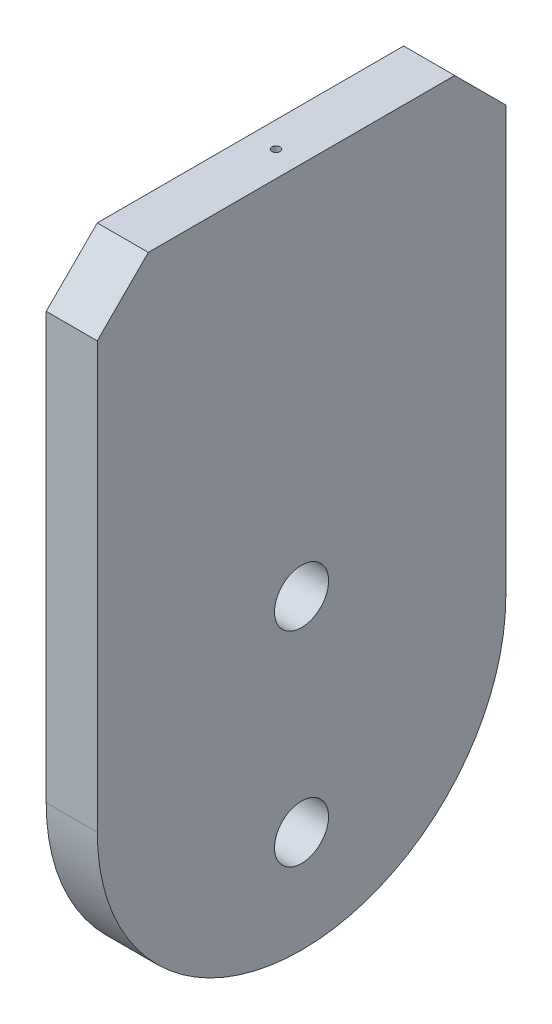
ISO-10303-21;
HEADER;
FILE_DESCRIPTION(('STEP AP214'),'2;1');
FILE_NAME('part.step','',(''),(''),'','','');
FILE_SCHEMA(('AUTOMOTIVE_DESIGN { 1 0 10303 214 1 1 1 1 }'));
ENDSEC;
DATA;
#1=APPLICATION_CONTEXT('core data for automotive mechanical design processes');
#2=APPLICATION_PROTOCOL_DEFINITION('international standard','automotive_design',2000,#1);
#3=PRODUCT_CONTEXT('',#1,'mechanical');
#4=PRODUCT('Part','Part','',(#3));
#5=PRODUCT_RELATED_PRODUCT_CATEGORY('part','',(#4));
#6=PRODUCT_DEFINITION_FORMATION('','',#4);
#7=PRODUCT_DEFINITION_CONTEXT('part definition',#1,'design');
#8=PRODUCT_DEFINITION('design','',#6,#7);
#9=PRODUCT_DEFINITION_SHAPE('','',#8);
#10=(LENGTH_UNIT() NAMED_UNIT(*) SI_UNIT(.MILLI.,.METRE.));
#11=(NAMED_UNIT(*) PLANE_ANGLE_UNIT() SI_UNIT($,.RADIAN.));
#12=(NAMED_UNIT(*) SI_UNIT($,.STERADIAN.) SOLID_ANGLE_UNIT());
#13=UNCERTAINTY_MEASURE_WITH_UNIT(LENGTH_MEASURE(1.E-05),#10,'distance_accuracy_value','');
#14=(GEOMETRIC_REPRESENTATION_CONTEXT(3) GLOBAL_UNCERTAINTY_ASSIGNED_CONTEXT((#13)) GLOBAL_UNIT_ASSIGNED_CONTEXT((#10,
#11,#12)) REPRESENTATION_CONTEXT('',''));
#15=CARTESIAN_POINT('',(0.,0.,0.));
#16=DIRECTION('',(0.,0.,1.));
#17=DIRECTION('',(1.,0.,0.));
#18=AXIS2_PLACEMENT_3D('',#15,#16,#17);
#19=CARTESIAN_POINT('',(4.76250000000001,0.,0.));
#20=DIRECTION('',(-1.,0.,0.));
#21=DIRECTION('',(0.,0.,1.));
#22=AXIS2_PLACEMENT_3D('',#19,#20,#21);
#23=CYLINDRICAL_SURFACE('',#22,38.1);
#24=CARTESIAN_POINT('',(-4.76250000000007,-4.44089209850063E-13,0.));
#25=DIRECTION('',(1.,0.,0.));
#26=DIRECTION('',(0.,0.,-1.));
#27=AXIS2_PLACEMENT_3D('',#24,#25,#26);
#28=CIRCLE('',#27,38.1);
#29=CARTESIAN_POINT('',(-4.7625,0.,38.1000000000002));
#30=VERTEX_POINT('',#29);
#31=CARTESIAN_POINT('',(-4.76249999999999,0.,-38.1));
#32=VERTEX_POINT('',#31);
#33=EDGE_CURVE('E87',#30,#32,#28,.T.);
#34=ORIENTED_EDGE('',*,*,#33,.T.);
#35=DIRECTION('',(-1.,0.,0.));
#36=VECTOR('',#35,1.);
#37=CARTESIAN_POINT('',(4.76249999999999,-6.66133814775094E-13,-38.1));
#38=LINE('',#37,#36);
#39=CARTESIAN_POINT('',(4.76249999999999,-6.66133814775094E-13,-38.1));
#40=VERTEX_POINT('',#39);
#41=EDGE_CURVE('E92',#40,#32,#38,.T.);
#42=ORIENTED_EDGE('',*,*,#41,.F.);
#43=CARTESIAN_POINT('',(4.76250000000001,0.,0.));
#44=DIRECTION('',(1.,0.,0.));
#45=DIRECTION('',(0.,0.,-1.));
#46=AXIS2_PLACEMENT_3D('',#43,#44,#45);
#47=CIRCLE('',#46,38.1);
#48=CARTESIAN_POINT('',(4.76249999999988,0.,38.1000000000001));
#49=VERTEX_POINT('',#48);
#50=EDGE_CURVE('E114',#49,#40,#47,.T.);
#51=ORIENTED_EDGE('',*,*,#50,.F.);
#52=DIRECTION('',(-1.,0.,0.));
#53=VECTOR('',#52,1.);
#54=CARTESIAN_POINT('',(4.76249999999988,0.,38.1000000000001));
#55=LINE('',#54,#53);
#56=EDGE_CURVE('E99',#49,#30,#55,.T.);
#57=ORIENTED_EDGE('',*,*,#56,.T.);
#58=EDGE_LOOP('',(#34,#42,#51,#57));
#59=FACE_BOUND('',#58,.T.);
#60=ADVANCED_FACE('F28',(#59),#23,.T.);
#61=CARTESIAN_POINT('',(4.76249999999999,-6.66133814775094E-13,-38.1));
#62=DIRECTION('',(0.,0.,1.));
#63=DIRECTION('',(1.,0.,0.));
#64=AXIS2_PLACEMENT_3D('',#61,#62,#63);
#65=PLANE('',#64);
#66=DIRECTION('',(0.,1.,0.));
#67=VECTOR('',#66,1.);
#68=CARTESIAN_POINT('',(-4.76249999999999,0.,-38.1));
#69=LINE('',#68,#67);
#70=CARTESIAN_POINT('',(-4.76250000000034,79.3749999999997,-38.1000000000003));
#71=VERTEX_POINT('',#70);
#72=EDGE_CURVE('E81',#32,#71,#69,.T.);
#73=ORIENTED_EDGE('',*,*,#72,.T.);
#74=DIRECTION('',(1.,0.,0.));
#75=VECTOR('',#74,1.);
#76=CARTESIAN_POINT('',(4.76249999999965,79.3749999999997,-38.1000000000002));
#77=LINE('',#76,#75);
#78=CARTESIAN_POINT('',(4.76249999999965,79.3749999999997,-38.1000000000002));
#79=VERTEX_POINT('',#78);
#80=EDGE_CURVE('E50',#71,#79,#77,.T.);
#81=ORIENTED_EDGE('',*,*,#80,.T.);
#82=DIRECTION('',(0.,1.,0.));
#83=VECTOR('',#82,1.);
#84=CARTESIAN_POINT('',(4.76249999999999,-6.66133814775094E-13,-38.1));
#85=LINE('',#84,#83);
#86=EDGE_CURVE('E94',#40,#79,#85,.T.);
#87=ORIENTED_EDGE('',*,*,#86,.F.);
#88=ORIENTED_EDGE('',*,*,#41,.T.);
#89=EDGE_LOOP('',(#73,#81,#87,#88));
#90=FACE_BOUND('',#89,.T.);
#91=ADVANCED_FACE('F93',(#90),#65,.F.);
#92=CARTESIAN_POINT('',(4.76249999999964,88.9,38.1000000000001));
#93=DIRECTION('',(0.,-1.,0.));
#94=DIRECTION('',(0.,0.,-1.));
#95=AXIS2_PLACEMENT_3D('',#92,#93,#94);
#96=PLANE('',#95);
#97=CARTESIAN_POINT('',(-4.21824828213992E-13,88.8999999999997,0.));
#98=DIRECTION('',(0.,1.,0.));
#99=DIRECTION('',(0.,0.,1.));
#100=AXIS2_PLACEMENT_3D('',#97,#98,#99);
#101=CIRCLE('',#100,0.761999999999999);
#102=CARTESIAN_POINT('',(-4.22474118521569E-13,88.8999999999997,0.761999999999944));
#103=VERTEX_POINT('',#102);
#104=EDGE_CURVE('E106',#103,#103,#101,.T.);
#105=ORIENTED_EDGE('',*,*,#104,.F.);
#106=EDGE_LOOP('',(#105));
#107=FACE_BOUND('',#106,.T.);
#108=DIRECTION('',(0.,0.,1.));
#109=VECTOR('',#108,1.);
#110=CARTESIAN_POINT('',(4.76249999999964,88.9,38.1000000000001));
#111=LINE('',#110,#109);
#112=CARTESIAN_POINT('',(4.76249999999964,88.8999999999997,-28.5750000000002));
#113=VERTEX_POINT('',#112);
#114=CARTESIAN_POINT('',(4.76249999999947,88.8999999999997,28.5750000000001));
#115=VERTEX_POINT('',#114);
#116=EDGE_CURVE('E117',#113,#115,#111,.T.);
#117=ORIENTED_EDGE('',*,*,#116,.F.);
#118=DIRECTION('',(-1.,0.,0.));
#119=VECTOR('',#118,1.);
#120=CARTESIAN_POINT('',(4.76249999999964,88.8999999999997,-28.5750000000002));
#121=LINE('',#120,#119);
#122=CARTESIAN_POINT('',(-4.76250000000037,88.8999999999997,-28.5750000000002));
#123=VERTEX_POINT('',#122);
#124=EDGE_CURVE('E123',#113,#123,#121,.T.);
#125=ORIENTED_EDGE('',*,*,#124,.T.);
#126=DIRECTION('',(0.,0.,1.));
#127=VECTOR('',#126,1.);
#128=CARTESIAN_POINT('',(-4.76250000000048,88.8999999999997,38.1));
#129=LINE('',#128,#127);
#130=CARTESIAN_POINT('',(-4.76250000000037,88.9,28.5750000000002));
#131=VERTEX_POINT('',#130);
#132=EDGE_CURVE('E89',#123,#131,#129,.T.);
#133=ORIENTED_EDGE('',*,*,#132,.T.);
#134=DIRECTION('',(1.,0.,0.));
#135=VECTOR('',#134,1.);
#136=CARTESIAN_POINT('',(4.76249999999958,88.8999999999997,28.5749999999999));
#137=LINE('',#136,#135);
#138=EDGE_CURVE('E98',#131,#115,#137,.T.);
#139=ORIENTED_EDGE('',*,*,#138,.T.);
#140=EDGE_LOOP('',(#117,#125,#133,#139));
#141=FACE_BOUND('',#140,.T.);
#142=ADVANCED_FACE('F136',(#107,#141),#96,.F.);
#143=CARTESIAN_POINT('',(4.76249999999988,0.,38.1000000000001));
#144=DIRECTION('',(0.,0.,-1.));
#145=DIRECTION('',(-1.,0.,0.));
#146=AXIS2_PLACEMENT_3D('',#143,#144,#145);
#147=PLANE('',#146);
#148=DIRECTION('',(0.,-1.,0.));
#149=VECTOR('',#148,1.);
#150=CARTESIAN_POINT('',(4.76249999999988,0.,38.1000000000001));
#151=LINE('',#150,#149);
#152=CARTESIAN_POINT('',(4.76249999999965,79.3749999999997,38.1000000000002));
#153=VERTEX_POINT('',#152);
#154=EDGE_CURVE('E119',#153,#49,#151,.T.);
#155=ORIENTED_EDGE('',*,*,#154,.F.);
#156=DIRECTION('',(-1.,0.,0.));
#157=VECTOR('',#156,1.);
#158=CARTESIAN_POINT('',(4.76249999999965,79.3749999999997,38.1000000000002));
#159=LINE('',#158,#157);
#160=CARTESIAN_POINT('',(-4.76250000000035,79.3749999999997,38.1));
#161=VERTEX_POINT('',#160);
#162=EDGE_CURVE('E11',#153,#161,#159,.T.);
#163=ORIENTED_EDGE('',*,*,#162,.T.);
#164=DIRECTION('',(0.,-1.,0.));
#165=VECTOR('',#164,1.);
#166=CARTESIAN_POINT('',(-4.7625,0.,38.1000000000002));
#167=LINE('',#166,#165);
#168=EDGE_CURVE('E112',#161,#30,#167,.T.);
#169=ORIENTED_EDGE('',*,*,#168,.T.);
#170=ORIENTED_EDGE('',*,*,#56,.F.);
#171=EDGE_LOOP('',(#155,#163,#169,#170));
#172=FACE_BOUND('',#171,.T.);
#173=ADVANCED_FACE('F158',(#172),#147,.F.);
#174=CARTESIAN_POINT('',(4.76250000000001,0.,0.));
#175=DIRECTION('',(1.,0.,0.));
#176=DIRECTION('',(0.,0.,-1.));
#177=AXIS2_PLACEMENT_3D('',#174,#175,#176);
#178=PLANE('',#177);
#179=CARTESIAN_POINT('',(4.76249999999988,19.05,0.));
#180=DIRECTION('',(1.,0.,0.));
#181=DIRECTION('',(0.,0.,-1.));
#182=AXIS2_PLACEMENT_3D('',#179,#180,#181);
#183=CIRCLE('',#182,5.04189563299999);
#184=CARTESIAN_POINT('',(4.76249999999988,19.05,-5.04189563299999));
#185=VERTEX_POINT('',#184);
#186=EDGE_CURVE('E172',#185,#185,#183,.T.);
#187=ORIENTED_EDGE('',*,*,#186,.F.);
#188=EDGE_LOOP('',(#187));
#189=FACE_BOUND('',#188,.T.);
#190=CARTESIAN_POINT('',(4.76250000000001,-19.05,0.));
#191=DIRECTION('',(1.,0.,0.));
#192=DIRECTION('',(0.,0.,-1.));
#193=AXIS2_PLACEMENT_3D('',#190,#191,#192);
#194=CIRCLE('',#193,5.04189563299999);
#195=CARTESIAN_POINT('',(4.76250000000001,-19.05,-5.04189563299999));
#196=VERTEX_POINT('',#195);
#197=EDGE_CURVE('E175',#196,#196,#194,.T.);
#198=ORIENTED_EDGE('',*,*,#197,.F.);
#199=EDGE_LOOP('',(#198));
#200=FACE_BOUND('',#199,.T.);
#201=ORIENTED_EDGE('',*,*,#86,.T.);
#202=DIRECTION('',(0.,-0.707106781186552,-0.707106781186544));
#203=VECTOR('',#202,1.);
#204=CARTESIAN_POINT('',(4.76249999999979,58.7374999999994,-58.7375000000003));
#205=LINE('',#204,#203);
#206=EDGE_CURVE('E35',#79,#113,#205,.F.);
#207=ORIENTED_EDGE('',*,*,#206,.T.);
#208=ORIENTED_EDGE('',*,*,#116,.T.);
#209=DIRECTION('',(0.,0.707106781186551,-0.707106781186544));
#210=VECTOR('',#209,1.);
#211=CARTESIAN_POINT('',(4.76249999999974,58.7374999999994,58.7375000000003));
#212=LINE('',#211,#210);
#213=EDGE_CURVE('E42',#115,#153,#212,.F.);
#214=ORIENTED_EDGE('',*,*,#213,.T.);
#215=ORIENTED_EDGE('',*,*,#154,.T.);
#216=ORIENTED_EDGE('',*,*,#50,.T.);
#217=EDGE_LOOP('',(#201,#207,#208,#214,#215,#216));
#218=FACE_BOUND('',#217,.T.);
#219=ADVANCED_FACE('F132',(#189,#200,#218),#178,.T.);
#220=CARTESIAN_POINT('',(-4.76250000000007,-4.44089209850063E-13,0.));
#221=DIRECTION('',(1.,0.,0.));
#222=DIRECTION('',(0.,0.,-1.));
#223=AXIS2_PLACEMENT_3D('',#220,#221,#222);
#224=PLANE('',#223);
#225=CARTESIAN_POINT('',(-4.76250000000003,19.05,0.));
#226=DIRECTION('',(1.,0.,0.));
#227=DIRECTION('',(0.,0.,-1.));
#228=AXIS2_PLACEMENT_3D('',#225,#226,#227);
#229=CIRCLE('',#228,5.041895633);
#230=CARTESIAN_POINT('',(-4.76250000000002,19.05,-5.041895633));
#231=VERTEX_POINT('',#230);
#232=EDGE_CURVE('E178',#231,#231,#229,.T.);
#233=ORIENTED_EDGE('',*,*,#232,.T.);
#234=EDGE_LOOP('',(#233));
#235=FACE_BOUND('',#234,.T.);
#236=CARTESIAN_POINT('',(-4.76249999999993,-19.05,0.));
#237=DIRECTION('',(1.,0.,0.));
#238=DIRECTION('',(0.,0.,-1.));
#239=AXIS2_PLACEMENT_3D('',#236,#237,#238);
#240=CIRCLE('',#239,5.041895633);
#241=CARTESIAN_POINT('',(-4.76249999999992,-19.05,-5.041895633));
#242=VERTEX_POINT('',#241);
#243=EDGE_CURVE('E177',#242,#242,#240,.T.);
#244=ORIENTED_EDGE('',*,*,#243,.T.);
#245=EDGE_LOOP('',(#244));
#246=FACE_BOUND('',#245,.T.);
#247=ORIENTED_EDGE('',*,*,#132,.F.);
#248=DIRECTION('',(0.,0.707106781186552,0.707106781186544));
#249=VECTOR('',#248,1.);
#250=CARTESIAN_POINT('',(-4.76250000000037,88.8999999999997,-28.5750000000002));
#251=LINE('',#250,#249);
#252=EDGE_CURVE('E88',#123,#71,#251,.F.);
#253=ORIENTED_EDGE('',*,*,#252,.T.);
#254=ORIENTED_EDGE('',*,*,#72,.F.);
#255=ORIENTED_EDGE('',*,*,#33,.F.);
#256=ORIENTED_EDGE('',*,*,#168,.F.);
#257=DIRECTION('',(0.,-0.707106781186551,0.707106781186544));
#258=VECTOR('',#257,1.);
#259=CARTESIAN_POINT('',(-4.76250000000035,79.3749999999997,38.1));
#260=LINE('',#259,#258);
#261=EDGE_CURVE('E126',#161,#131,#260,.F.);
#262=ORIENTED_EDGE('',*,*,#261,.T.);
#263=EDGE_LOOP('',(#247,#253,#254,#255,#256,#262));
#264=FACE_BOUND('',#263,.T.);
#265=ADVANCED_FACE('F84',(#235,#246,#264),#224,.F.);
#266=CARTESIAN_POINT('',(4.76249999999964,88.8999999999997,-28.5750000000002));
#267=DIRECTION('',(0.,-0.707106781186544,0.707106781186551));
#268=DIRECTION('',(0.,-0.707106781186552,-0.707106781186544));
#269=AXIS2_PLACEMENT_3D('',#266,#267,#268);
#270=PLANE('',#269);
#271=ORIENTED_EDGE('',*,*,#206,.F.);
#272=ORIENTED_EDGE('',*,*,#80,.F.);
#273=ORIENTED_EDGE('',*,*,#252,.F.);
#274=ORIENTED_EDGE('',*,*,#124,.F.);
#275=EDGE_LOOP('',(#271,#272,#273,#274));
#276=FACE_BOUND('',#275,.T.);
#277=ADVANCED_FACE('F138',(#276),#270,.F.);
#278=CARTESIAN_POINT('',(4.76249999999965,79.3749999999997,38.1000000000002));
#279=DIRECTION('',(0.,-0.707106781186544,-0.707106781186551));
#280=DIRECTION('',(0.,0.707106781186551,-0.707106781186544));
#281=AXIS2_PLACEMENT_3D('',#278,#279,#280);
#282=PLANE('',#281);
#283=ORIENTED_EDGE('',*,*,#213,.F.);
#284=ORIENTED_EDGE('',*,*,#138,.F.);
#285=ORIENTED_EDGE('',*,*,#261,.F.);
#286=ORIENTED_EDGE('',*,*,#162,.F.);
#287=EDGE_LOOP('',(#283,#284,#285,#286));
#288=FACE_BOUND('',#287,.T.);
#289=ADVANCED_FACE('F140',(#288),#282,.F.);
#290=CARTESIAN_POINT('',(-3.19145869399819E-13,82.5499999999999,0.));
#291=DIRECTION('',(0.,1.,0.));
#292=DIRECTION('',(0.,0.,1.));
#293=AXIS2_PLACEMENT_3D('',#290,#291,#292);
#294=CYLINDRICAL_SURFACE('',#293,0.761999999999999);
#295=CARTESIAN_POINT('',(-3.19145869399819E-13,82.5499999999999,0.));
#296=DIRECTION('',(0.,1.,0.));
#297=DIRECTION('',(0.,0.,1.));
#298=AXIS2_PLACEMENT_3D('',#295,#296,#297);
#299=CIRCLE('',#298,0.761999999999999);
#300=CARTESIAN_POINT('',(-3.19795159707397E-13,82.5499999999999,0.761999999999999));
#301=VERTEX_POINT('',#300);
#302=EDGE_CURVE('E103',#301,#301,#299,.T.);
#303=ORIENTED_EDGE('',*,*,#302,.F.);
#304=EDGE_LOOP('',(#303));
#305=FACE_BOUND('',#304,.T.);
#306=ORIENTED_EDGE('',*,*,#104,.T.);
#307=EDGE_LOOP('',(#306));
#308=FACE_BOUND('',#307,.T.);
#309=ADVANCED_FACE('F146',(#305,#308),#294,.F.);
#310=CARTESIAN_POINT('',(-3.19145869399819E-13,82.5499999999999,0.));
#311=DIRECTION('',(0.,1.,0.));
#312=DIRECTION('',(0.,0.,1.));
#313=AXIS2_PLACEMENT_3D('',#310,#311,#312);
#314=PLANE('',#313);
#315=ORIENTED_EDGE('',*,*,#302,.T.);
#316=EDGE_LOOP('',(#315));
#317=FACE_BOUND('',#316,.T.);
#318=ADVANCED_FACE('F189',(#317),#314,.T.);
#319=CARTESIAN_POINT('',(4.76250000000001,-19.05,0.));
#320=DIRECTION('',(1.,0.,0.));
#321=DIRECTION('',(0.,0.,-1.));
#322=AXIS2_PLACEMENT_3D('',#319,#320,#321);
#323=CYLINDRICAL_SURFACE('',#322,5.04189563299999);
#324=ORIENTED_EDGE('',*,*,#243,.F.);
#325=EDGE_LOOP('',(#324));
#326=FACE_BOUND('',#325,.T.);
#327=ORIENTED_EDGE('',*,*,#197,.T.);
#328=EDGE_LOOP('',(#327));
#329=FACE_BOUND('',#328,.T.);
#330=ADVANCED_FACE('F195',(#326,#329),#323,.F.);
#331=CARTESIAN_POINT('',(4.76249999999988,19.05,0.));
#332=DIRECTION('',(1.,0.,0.));
#333=DIRECTION('',(0.,0.,-1.));
#334=AXIS2_PLACEMENT_3D('',#331,#332,#333);
#335=CYLINDRICAL_SURFACE('',#334,5.04189563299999);
#336=ORIENTED_EDGE('',*,*,#232,.F.);
#337=EDGE_LOOP('',(#336));
#338=FACE_BOUND('',#337,.T.);
#339=ORIENTED_EDGE('',*,*,#186,.T.);
#340=EDGE_LOOP('',(#339));
#341=FACE_BOUND('',#340,.T.);
#342=ADVANCED_FACE('F202',(#338,#341),#335,.F.);
#343=CLOSED_SHELL('',(#60,#91,#142,#173,#219,#265,#277,#289,#309,#318,#330,#342));
#344=MANIFOLD_SOLID_BREP('B2',#343);
#345=ADVANCED_BREP_SHAPE_REPRESENTATION('',(#18,#344),#14);
#346=SHAPE_DEFINITION_REPRESENTATION(#9,#345);
ENDSEC;
END-ISO-10303-21;
